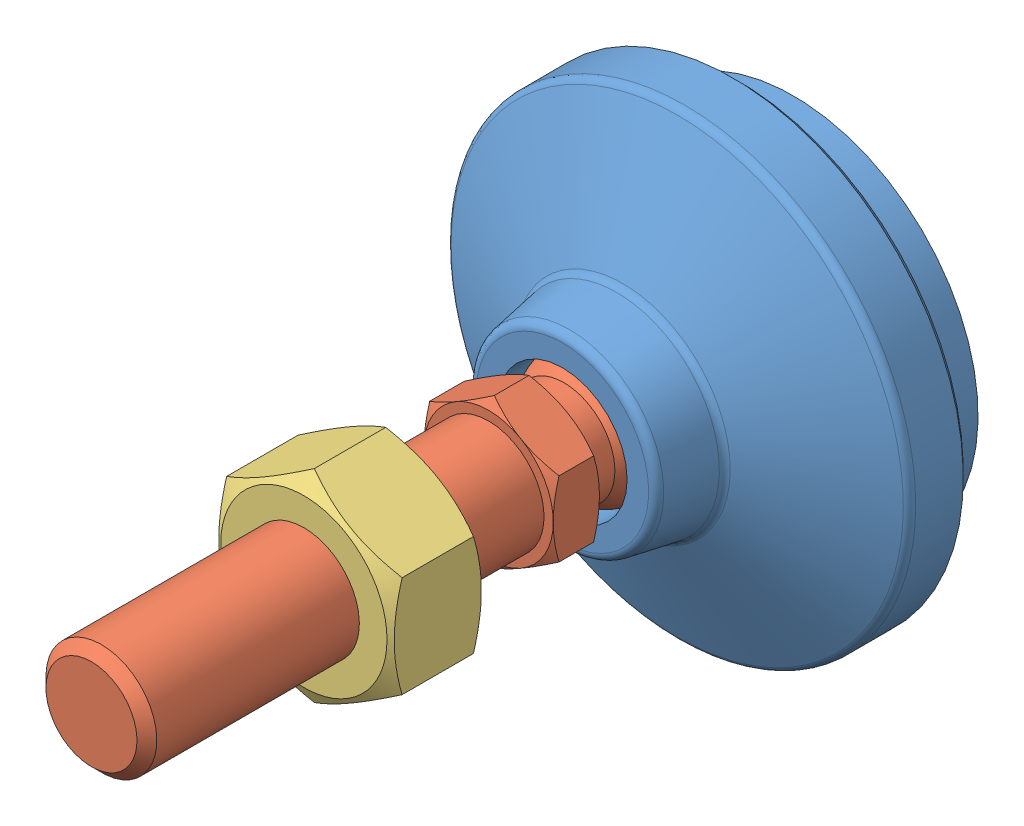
SolidWorks assembly LSVA50-M12X43.sldasm, configuration Default (file format 15000). Lengths in mm.
Overall size (50 50 76).
3 component instances, 3 part files, 0 mates.
Components (placement in the parent):
- LSVA50-M12X43_01-1: LSVA50-M12X43_01.SLDPRT [ﾃﾞﾌｫﾙﾄ] at (0 0 6) x (1 0 0) z (0 -1 0) size (50 25 50)
- LSVA50-M12X43_02-1: LSVA50-M12X43_02.SLDPRT [ﾃﾞﾌｫﾙﾄ] at (0 0 13.5) x (1 0 0) z (0 -1 0) size (14 62.5 16.17)
- LSVA50-M12X43_03-1: LSVA50-M12X43_03.SLDPRT [ﾃﾞﾌｫﾙﾄ] at (0 0 43) size (19 21.94 10)
